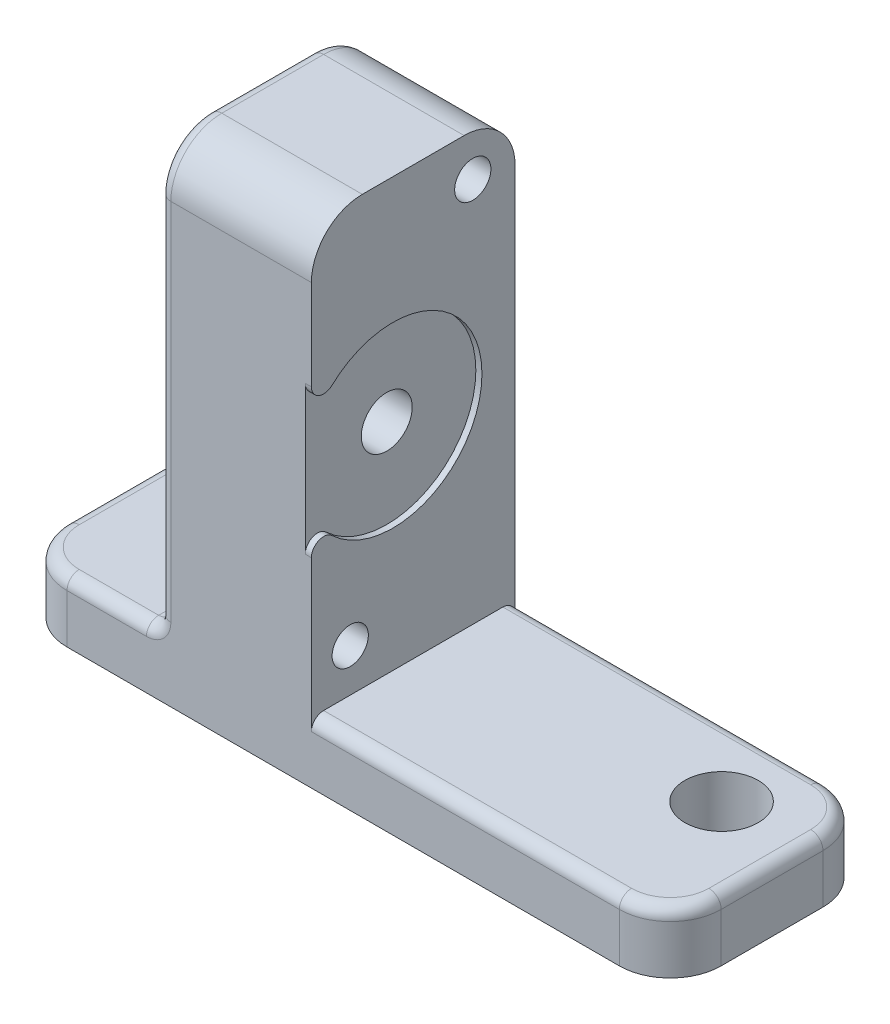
from build123d import *

# Parameters (mm, degrees)
BOSS_EXTRUDE1_DEPTH              = 5.08
BOSS_EXTRUDE1_DEPTH_BACK         = 7.62
F_1_8_0_125_DIAMETER_HOLE1_D     = 3.175
F_1_8_0_125_DIAMETER_HOLE1_DEPTH = 5.715
F_15_0_18_DIAMETER_HOLE1_D       = 4.572
SKETCH9_R                        = 5.55625
CUT_EXTRUDE2_DEPTH               = 0.381
FILLET1_R                        = 3.175
F_4_40_TAPPED_HOLE1_D            = 2.2606
FILLET2_R                        = 0.762


with BuildPart() as part:
    # Sketch1 → Boss-Extrude1 (new, two sides: drawn at the far end of the back side and taken through both)
    with BuildSketch(Plane.XY.offset(-BOSS_EXTRUDE1_DEPTH_BACK)):
        Polygon((-20.3962, 0), (20.3962, 0), (20.3962, 3.81), (-1.9812, 3.81), (-1.9812, 30.48), (-11.5062, 30.48), (-11.5062, 3.81), (-20.3962, 3.81), align=None)
    extrude(amount=BOSS_EXTRUDE1_DEPTH + BOSS_EXTRUDE1_DEPTH_BACK)

    # 1_8 _0.125_ Diameter Hole1
    with Locations(Plane(origin=(-1.9812, 0, 0), x_dir=(0, 0, 1), z_dir=(1, 0, 0))):
        with Locations((0, -17.054916)):
            Hole(F_1_8_0_125_DIAMETER_HOLE1_D / 2, depth=F_1_8_0_125_DIAMETER_HOLE1_DEPTH)

    # 15 _0.18_ Diameter Hole1 (through all)
    with Locations(Plane(origin=(0, 3.81, 0), x_dir=(1, 0, 0), z_dir=(0, 1, 0))):
        with Locations((-15.9004, 3.175), (15.3416, 3.175)):
            Hole(F_15_0_18_DIAMETER_HOLE1_D / 2)

    # Sketch9 → Cut-Extrude2 (cut)
    with BuildSketch(Plane(origin=(-1.9812, 0, 0), x_dir=(0, 0, -1), z_dir=(1, 0, 0))):
        with Locations((0, 17.054916)):
            Circle(SKETCH9_R)
    extrude(amount=-CUT_EXTRUDE2_DEPTH, mode=Mode.SUBTRACT)

    # Fillet1
    fillet1_edges = [part.edges().sort_by_distance(p)[0] for p in [
        (20.3962, 1.905, -7.62),
        (-6.7437, 30.48, -7.62),
        (-20.3962, 1.905, 5.08),
        (20.3962, 1.905, 5.08),
        (-6.7437, 30.48, 5.08),
        (-20.3962, 1.905, -7.62),
    ]]
    fillet(fillet1_edges, radius=FILLET1_R)

    # 4-40 Tapped Hole1 (through all)
    with Locations(Plane.ZY.offset(11.5062)):
        with Locations((-4.983815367, 27.843815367), (2.658553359, 6.485446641), (0, 17.054916)):
            Hole(F_4_40_TAPPED_HOLE1_D / 2)

    # Fillet2
    fillet2_edges = [part.edges().sort_by_distance(p)[0] for p in [
        (-11.5062, 3.81, -1.27),
        (-14.3637, 3.81, 5.08),
        (-14.3637, 3.81, -7.62),
        (-2.1717, 19.305585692, 5.08),
        (-2.1717, 14.804246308, 5.08),
        (-20.3962, 3.81, -1.27),
        (-11.5062, 15.5575, -7.62),
        (7.62, 3.81, -7.62),
        (-19.46626403, 3.81, 4.15006403),
        (-19.46626403, 3.81, -6.69006403),
        (20.3962, 3.81, -1.27),
        (7.62, 3.81, 5.08),
        (19.46626403, 3.81, 4.15006403),
        (19.46626403, 3.81, -6.69006403),
        (-11.5062, 15.5575, 5.08),
        (-11.5062, 30.48, -1.27),
        (-11.5062, 29.55006403, 4.15006403),
        (-11.5062, 29.55006403, -6.69006403),
    ]]
    fillet(fillet2_edges, radius=FILLET2_R)


solid = part.part
